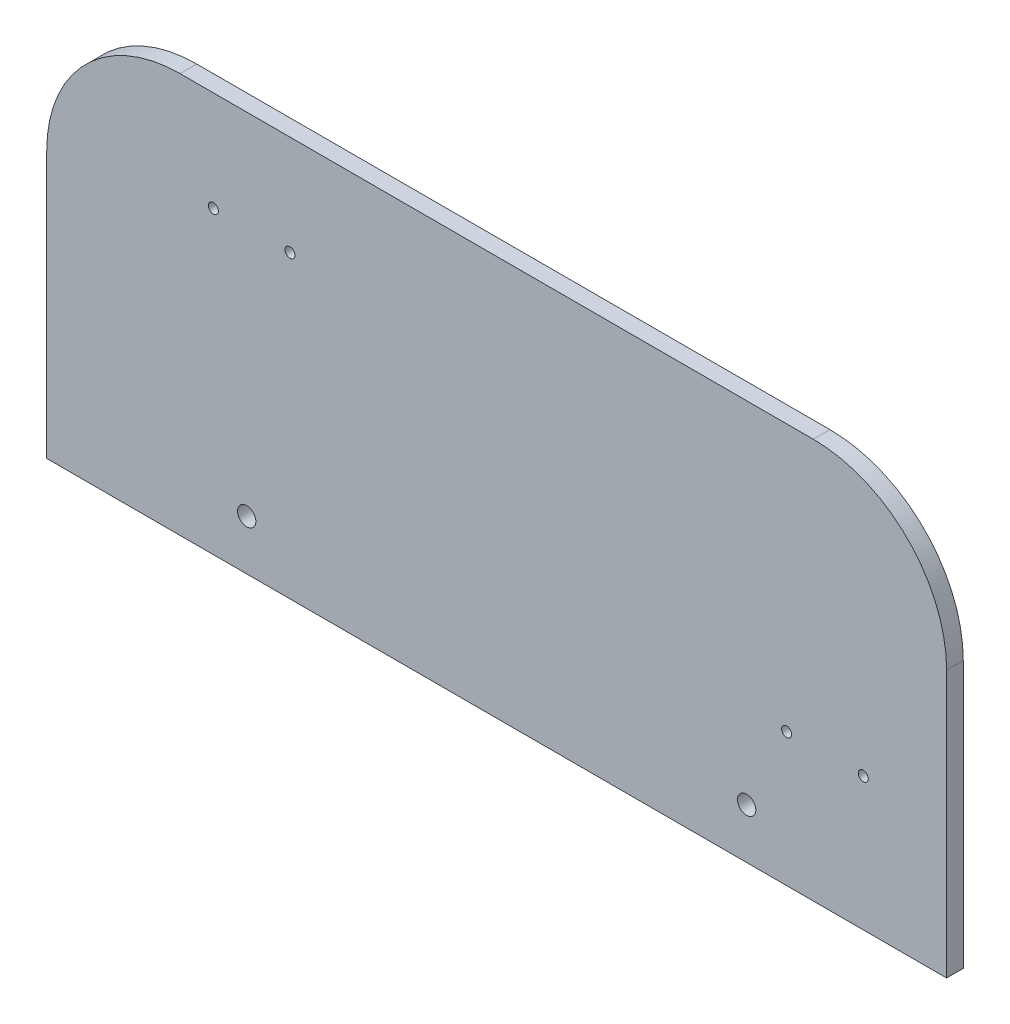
from build123d import *

# Parameters (mm, degrees)
ESQUISSE1_R          = 2.75
ESQUISSE1_R_2        = 1.5
BASE_EXTRUSION_DEPTH = 2.5


with BuildPart() as part:
    # Esquisse1 → Base-Extrusion (new, symmetric)
    with BuildSketch(Plane.XY):
        with BuildLine():
            Line((-95, 120), (95, 120))
            ThreePointArc((95, 120), (123.284271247, 108.284271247), (135, 80))
            Line((135, 80), (135, 0))
            Line((135, 0), (-135, 0))
            Line((-135, 0), (-135, 80))
            ThreePointArc((-135, 80), (-123.284271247, 108.284271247), (-95, 120))
        make_face()
        with Locations((75, 15)):
            Circle(ESQUISSE1_R, mode=Mode.SUBTRACT)
        with Locations((-75, 15)):
            Circle(ESQUISSE1_R, mode=Mode.SUBTRACT)
        with Locations((-85, 90)):
            Circle(ESQUISSE1_R_2, mode=Mode.SUBTRACT)
        with Locations((-62, 90)):
            Circle(ESQUISSE1_R_2, mode=Mode.SUBTRACT)
        with Locations((87, 40)):
            Circle(ESQUISSE1_R_2, mode=Mode.SUBTRACT)
        with Locations((110, 40)):
            Circle(ESQUISSE1_R_2, mode=Mode.SUBTRACT)
    extrude(amount=BASE_EXTRUSION_DEPTH, both=True)


solid = part.part
